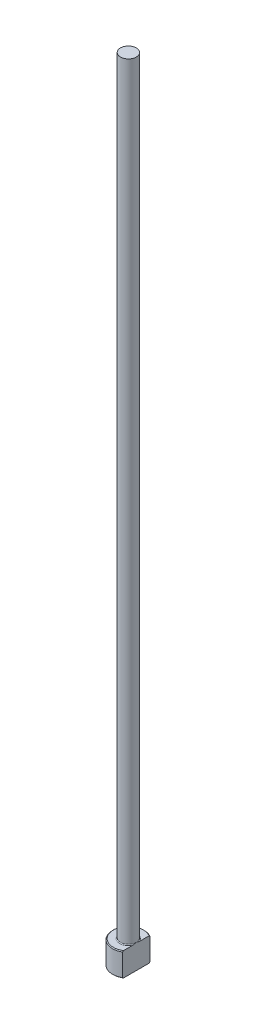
ISO-10303-21;
HEADER;
FILE_DESCRIPTION(('STEP AP214'),'2;1');
FILE_NAME('part.step','',(''),(''),'','','');
FILE_SCHEMA(('AUTOMOTIVE_DESIGN { 1 0 10303 214 1 1 1 1 }'));
ENDSEC;
DATA;
#1=APPLICATION_CONTEXT('core data for automotive mechanical design processes');
#2=APPLICATION_PROTOCOL_DEFINITION('international standard','automotive_design',2000,#1);
#3=PRODUCT_CONTEXT('',#1,'mechanical');
#4=PRODUCT('Part','Part','',(#3));
#5=PRODUCT_RELATED_PRODUCT_CATEGORY('part','',(#4));
#6=PRODUCT_DEFINITION_FORMATION('','',#4);
#7=PRODUCT_DEFINITION_CONTEXT('part definition',#1,'design');
#8=PRODUCT_DEFINITION('design','',#6,#7);
#9=PRODUCT_DEFINITION_SHAPE('','',#8);
#10=(LENGTH_UNIT() NAMED_UNIT(*) SI_UNIT(.MILLI.,.METRE.));
#11=(NAMED_UNIT(*) PLANE_ANGLE_UNIT() SI_UNIT($,.RADIAN.));
#12=(NAMED_UNIT(*) SI_UNIT($,.STERADIAN.) SOLID_ANGLE_UNIT());
#13=UNCERTAINTY_MEASURE_WITH_UNIT(LENGTH_MEASURE(1.E-05),#10,'distance_accuracy_value','');
#14=(GEOMETRIC_REPRESENTATION_CONTEXT(3) GLOBAL_UNCERTAINTY_ASSIGNED_CONTEXT((#13)) GLOBAL_UNIT_ASSIGNED_CONTEXT((#10,
#11,#12)) REPRESENTATION_CONTEXT('',''));
#15=CARTESIAN_POINT('',(0.,0.,0.));
#16=DIRECTION('',(0.,0.,1.));
#17=DIRECTION('',(1.,0.,0.));
#18=AXIS2_PLACEMENT_3D('',#15,#16,#17);
#19=CARTESIAN_POINT('',(0.,0.,0.));
#20=DIRECTION('',(0.,-1.,0.));
#21=DIRECTION('',(0.,0.,-1.));
#22=AXIS2_PLACEMENT_3D('',#19,#20,#21);
#23=PLANE('',#22);
#24=CARTESIAN_POINT('',(0.,0.,0.));
#25=DIRECTION('',(0.,-1.,0.));
#26=DIRECTION('',(0.,0.,-1.));
#27=AXIS2_PLACEMENT_3D('',#24,#25,#26);
#28=CIRCLE('',#27,3.79999999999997);
#29=CARTESIAN_POINT('',(1.99999999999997,0.,3.23109888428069));
#30=VERTEX_POINT('',#29);
#31=CARTESIAN_POINT('',(1.99999999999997,0.,-3.23109888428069));
#32=VERTEX_POINT('',#31);
#33=EDGE_CURVE('E98',#30,#32,#28,.T.);
#34=ORIENTED_EDGE('',*,*,#33,.T.);
#35=DIRECTION('',(0.,0.,1.));
#36=VECTOR('',#35,1.);
#37=CARTESIAN_POINT('',(1.99999999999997,0.,3.46410161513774));
#38=LINE('',#37,#36);
#39=EDGE_CURVE('E83',#32,#30,#38,.T.);
#40=ORIENTED_EDGE('',*,*,#39,.T.);
#41=EDGE_LOOP('',(#34,#40));
#42=FACE_BOUND('',#41,.T.);
#43=ADVANCED_FACE('F32',(#42),#23,.T.);
#44=CARTESIAN_POINT('',(0.,259.958771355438,0.));
#45=DIRECTION('',(0.,1.,0.));
#46=DIRECTION('',(0.,0.,1.));
#47=AXIS2_PLACEMENT_3D('',#44,#45,#46);
#48=CYLINDRICAL_SURFACE('',#47,3.99999999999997);
#49=CARTESIAN_POINT('',(0.,5.80000000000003,0.));
#50=DIRECTION('',(0.,1.,0.));
#51=DIRECTION('',(0.,0.,1.));
#52=AXIS2_PLACEMENT_3D('',#49,#50,#51);
#53=CIRCLE('',#52,3.99999999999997);
#54=CARTESIAN_POINT('',(1.99999999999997,5.80000000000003,3.46410161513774));
#55=VERTEX_POINT('',#54);
#56=CARTESIAN_POINT('',(1.99999999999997,5.80000000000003,-3.46410161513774));
#57=VERTEX_POINT('',#56);
#58=EDGE_CURVE('E104',#55,#57,#53,.F.);
#59=ORIENTED_EDGE('',*,*,#58,.T.);
#60=DIRECTION('',(0.,-1.,0.));
#61=VECTOR('',#60,1.);
#62=CARTESIAN_POINT('',(1.99999999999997,200.,-3.46410161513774));
#63=LINE('',#62,#61);
#64=CARTESIAN_POINT('',(1.99999999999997,0.199999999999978,-3.46410161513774));
#65=VERTEX_POINT('',#64);
#66=EDGE_CURVE('E183',#57,#65,#63,.T.);
#67=ORIENTED_EDGE('',*,*,#66,.T.);
#68=CARTESIAN_POINT('',(0.,0.199999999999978,0.));
#69=DIRECTION('',(0.,-1.,0.));
#70=DIRECTION('',(0.,0.,-1.));
#71=AXIS2_PLACEMENT_3D('',#68,#69,#70);
#72=CIRCLE('',#71,3.99999999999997);
#73=CARTESIAN_POINT('',(1.99999999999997,0.199999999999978,3.46410161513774));
#74=VERTEX_POINT('',#73);
#75=EDGE_CURVE('E100',#65,#74,#72,.F.);
#76=ORIENTED_EDGE('',*,*,#75,.T.);
#77=DIRECTION('',(0.,-1.,0.));
#78=VECTOR('',#77,1.);
#79=CARTESIAN_POINT('',(1.99999999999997,200.,3.46410161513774));
#80=LINE('',#79,#78);
#81=EDGE_CURVE('E93',#55,#74,#80,.T.);
#82=ORIENTED_EDGE('',*,*,#81,.F.);
#83=EDGE_LOOP('',(#59,#67,#76,#82));
#84=FACE_BOUND('',#83,.T.);
#85=ADVANCED_FACE('F158',(#84),#48,.T.);
#86=CARTESIAN_POINT('',(-3.99999999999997,6.,0.));
#87=DIRECTION('',(0.,1.,0.));
#88=DIRECTION('',(0.,0.,1.));
#89=AXIS2_PLACEMENT_3D('',#86,#87,#88);
#90=PLANE('',#89);
#91=CARTESIAN_POINT('',(0.,6.,0.));
#92=DIRECTION('',(0.,1.,0.));
#93=DIRECTION('',(0.,0.,1.));
#94=AXIS2_PLACEMENT_3D('',#91,#92,#93);
#95=CIRCLE('',#94,3.80000000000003);
#96=CARTESIAN_POINT('',(1.99999999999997,6.,-3.23109888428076));
#97=VERTEX_POINT('',#96);
#98=CARTESIAN_POINT('',(1.99999999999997,6.,3.23109888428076));
#99=VERTEX_POINT('',#98);
#100=EDGE_CURVE('E178',#97,#99,#95,.T.);
#101=ORIENTED_EDGE('',*,*,#100,.T.);
#102=DIRECTION('',(0.,0.,-1.));
#103=VECTOR('',#102,1.);
#104=CARTESIAN_POINT('',(1.99999999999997,6.,0.));
#105=LINE('',#104,#103);
#106=CARTESIAN_POINT('',(1.99999999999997,5.99999999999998,0.916515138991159));
#107=VERTEX_POINT('',#106);
#108=EDGE_CURVE('E57',#99,#107,#105,.T.);
#109=ORIENTED_EDGE('',*,*,#108,.T.);
#110=CARTESIAN_POINT('',(0.,6.,0.));
#111=DIRECTION('',(0.,1.,0.));
#112=DIRECTION('',(0.,0.,1.));
#113=AXIS2_PLACEMENT_3D('',#110,#111,#112);
#114=CIRCLE('',#113,2.19999999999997);
#115=CARTESIAN_POINT('',(1.99999999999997,5.99999999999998,-0.916515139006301));
#116=VERTEX_POINT('',#115);
#117=EDGE_CURVE('E107',#107,#116,#114,.F.);
#118=ORIENTED_EDGE('',*,*,#117,.T.);
#119=EDGE_CURVE('E136',#116,#97,#105,.T.);
#120=ORIENTED_EDGE('',*,*,#119,.T.);
#121=EDGE_LOOP('',(#101,#109,#118,#120));
#122=FACE_BOUND('',#121,.T.);
#123=ADVANCED_FACE('F147',(#122),#90,.T.);
#124=CARTESIAN_POINT('',(0.,6.00000000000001,0.));
#125=DIRECTION('',(0.,-1.,0.));
#126=DIRECTION('',(0.,0.,-1.));
#127=AXIS2_PLACEMENT_3D('',#124,#125,#126);
#128=CONICAL_SURFACE('',#127,3.80000000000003,0.785398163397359);
#129=ORIENTED_EDGE('',*,*,#58,.F.);
#130=CARTESIAN_POINT('',(1.99999999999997,1.91904532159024,7.62295524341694));
#131=CARTESIAN_POINT('',(1.99999999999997,2.08611243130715,7.4502239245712));
#132=CARTESIAN_POINT('',(1.99999999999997,2.25300024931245,7.27731861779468));
#133=CARTESIAN_POINT('',(1.99999999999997,2.58631125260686,6.93105655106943));
#134=CARTESIAN_POINT('',(1.99999999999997,2.75273443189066,6.75769978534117));
#135=CARTESIAN_POINT('',(1.99999999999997,3.08509080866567,6.41034692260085));
#136=CARTESIAN_POINT('',(1.99999999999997,3.25102371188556,6.23635054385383));
#137=CARTESIAN_POINT('',(1.99999999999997,3.58215598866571,5.88766284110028));
#138=CARTESIAN_POINT('',(1.99999999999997,3.74735536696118,5.71297152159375));
#139=CARTESIAN_POINT('',(1.99999999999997,4.0735385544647,5.36616839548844));
#140=CARTESIAN_POINT('',(1.99999999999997,4.23454099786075,5.19407412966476));
#141=CARTESIAN_POINT('',(1.99999999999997,4.55534102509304,4.8487666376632));
#142=CARTESIAN_POINT('',(1.99999999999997,4.71513861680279,4.67555341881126));
#143=CARTESIAN_POINT('',(1.99999999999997,5.0330618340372,4.32766569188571));
#144=CARTESIAN_POINT('',(1.99999999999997,5.19118781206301,4.15299150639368));
#145=CARTESIAN_POINT('',(1.99999999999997,5.50513944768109,3.80159134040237));
#146=CARTESIAN_POINT('',(1.99999999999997,5.66096519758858,3.62486544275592));
#147=CARTESIAN_POINT('',(1.99999999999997,5.90974646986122,3.33722425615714));
#148=CARTESIAN_POINT('',(1.99999999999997,6.00376148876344,3.22722645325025));
#149=CARTESIAN_POINT('',(1.99999999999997,6.19011825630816,3.00579987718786));
#150=CARTESIAN_POINT('',(1.99999999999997,6.28245983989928,2.89437096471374));
#151=CARTESIAN_POINT('',(1.99999999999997,6.46586188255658,2.66849662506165));
#152=CARTESIAN_POINT('',(1.99999999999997,6.55689849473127,2.5540317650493));
#153=CARTESIAN_POINT('',(1.99999999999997,6.73578809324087,2.32266819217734));
#154=CARTESIAN_POINT('',(1.99999999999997,6.82364184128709,2.20577007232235));
#155=CARTESIAN_POINT('',(1.99999999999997,6.99612756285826,1.96688707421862));
#156=CARTESIAN_POINT('',(1.99999999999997,7.08069035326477,1.84485190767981));
#157=CARTESIAN_POINT('',(1.99999999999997,7.24300264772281,1.59599329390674));
#158=CARTESIAN_POINT('',(1.99999999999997,7.32074277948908,1.46916359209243));
#159=CARTESIAN_POINT('',(1.99999999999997,7.42869763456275,1.27510066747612));
#160=CARTESIAN_POINT('',(1.99999999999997,7.46305374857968,1.21018943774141));
#161=CARTESIAN_POINT('',(1.99999999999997,7.52837146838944,1.07868835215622));
#162=CARTESIAN_POINT('',(1.99999999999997,7.55933245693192,1.01209819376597));
#163=CARTESIAN_POINT('',(1.99999999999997,7.6456686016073,0.809894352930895));
#164=CARTESIAN_POINT('',(1.99999999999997,7.69478214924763,0.671360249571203));
#165=CARTESIAN_POINT('',(1.99999999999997,7.74794829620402,0.463657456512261));
#166=CARTESIAN_POINT('',(1.99999999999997,7.76205065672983,0.397033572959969));
#167=CARTESIAN_POINT('',(1.99999999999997,7.78390371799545,0.262728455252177));
#168=CARTESIAN_POINT('',(1.99999999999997,7.79165498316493,0.195047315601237));
#169=CARTESIAN_POINT('',(1.99999999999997,7.80025690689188,0.0594528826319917));
#170=CARTESIAN_POINT('',(1.99999999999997,7.80112894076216,-0.00845903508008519));
#171=CARTESIAN_POINT('',(1.99999999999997,7.79596585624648,-0.144020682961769));
#172=CARTESIAN_POINT('',(1.99999999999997,7.78993016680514,-0.211670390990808));
#173=CARTESIAN_POINT('',(1.99999999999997,7.7714536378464,-0.345483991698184));
#174=CARTESIAN_POINT('',(1.99999999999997,7.75906777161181,-0.411655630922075));
#175=CARTESIAN_POINT('',(1.99999999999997,7.7286636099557,-0.542678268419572));
#176=CARTESIAN_POINT('',(1.99999999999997,7.7106446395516,-0.607529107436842));
#177=CARTESIAN_POINT('',(1.99999999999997,7.66972939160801,-0.73606439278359));
#178=CARTESIAN_POINT('',(1.99999999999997,7.64680564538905,-0.799739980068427));
#179=CARTESIAN_POINT('',(1.99999999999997,7.59700147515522,-0.925489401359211));
#180=CARTESIAN_POINT('',(1.99999999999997,7.57012185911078,-0.987563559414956));
#181=CARTESIAN_POINT('',(1.99999999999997,7.48443518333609,-1.17209020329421));
#182=CARTESIAN_POINT('',(1.99999999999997,7.42077407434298,-1.29228210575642));
#183=CARTESIAN_POINT('',(1.99999999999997,7.28502644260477,-1.52785770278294));
#184=CARTESIAN_POINT('',(1.99999999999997,7.21292931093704,-1.64323509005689));
#185=CARTESIAN_POINT('',(1.99999999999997,7.0628151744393,-1.87069387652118));
#186=CARTESIAN_POINT('',(1.99999999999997,6.98477595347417,-1.98276048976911));
#187=CARTESIAN_POINT('',(1.99999999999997,6.82481971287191,-2.20397837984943));
#188=CARTESIAN_POINT('',(1.99999999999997,6.74290465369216,-2.31313108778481));
#189=CARTESIAN_POINT('',(1.99999999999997,6.57517222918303,-2.53068545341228));
#190=CARTESIAN_POINT('',(1.99999999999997,6.48931769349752,-2.63905831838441));
#191=CARTESIAN_POINT('',(1.99999999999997,6.31548151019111,-2.85409686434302));
#192=CARTESIAN_POINT('',(1.99999999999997,6.22749963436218,-2.96076236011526));
#193=CARTESIAN_POINT('',(1.99999999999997,6.05015030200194,-3.17249211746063));
#194=CARTESIAN_POINT('',(1.99999999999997,5.96078672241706,-3.27755963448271));
#195=CARTESIAN_POINT('',(1.99999999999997,5.78082366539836,-3.48663191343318));
#196=CARTESIAN_POINT('',(1.99999999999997,5.69022416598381,-3.59063665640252));
#197=CARTESIAN_POINT('',(1.99999999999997,5.44796733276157,-3.86612439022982));
#198=CARTESIAN_POINT('',(1.99999999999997,5.29545972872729,-4.03685912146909));
#199=CARTESIAN_POINT('',(1.99999999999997,4.98858070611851,-4.3766480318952));
#200=CARTESIAN_POINT('',(1.99999999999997,4.83420923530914,-4.54570216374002));
#201=CARTESIAN_POINT('',(1.99999999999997,4.52396102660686,-4.882716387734));
#202=CARTESIAN_POINT('',(1.99999999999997,4.36808300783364,-5.05067529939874));
#203=CARTESIAN_POINT('',(1.99999999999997,4.05530513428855,-5.38563883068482));
#204=CARTESIAN_POINT('',(1.99999999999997,3.89840527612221,-5.55264344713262));
#205=CARTESIAN_POINT('',(1.99999999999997,3.59029018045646,-5.87905385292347));
#206=CARTESIAN_POINT('',(1.99999999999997,3.43910664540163,-6.03848959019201));
#207=CARTESIAN_POINT('',(1.99999999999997,3.13616436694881,-6.3568145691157));
#208=CARTESIAN_POINT('',(1.99999999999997,2.98440562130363,-6.51570380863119));
#209=CARTESIAN_POINT('',(1.99999999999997,2.68059501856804,-6.83286192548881));
#210=CARTESIAN_POINT('',(1.99999999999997,2.52854367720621,-6.99113129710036));
#211=CARTESIAN_POINT('',(1.99999999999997,2.22406035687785,-7.30730102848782));
#212=CARTESIAN_POINT('',(1.99999999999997,2.07162838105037,-7.46520139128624));
#213=CARTESIAN_POINT('',(1.99999999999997,1.91904532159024,-7.62295524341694));
#214=B_SPLINE_CURVE_WITH_KNOTS('',3,(#130,#131,#132,#133,#134,#135,#136,#137,#138,#139,#140,
#141,#142,#143,#144,#145,#146,#147,#148,#149,#150,#151,#152,#153,#154,#155,#156,#157,#158,#159,
#160,#161,#162,#163,#164,#165,#166,#167,#168,#169,#170,#171,#172,#173,#174,#175,#176,#177,#178,
#179,#180,#181,#182,#183,#184,#185,#186,#187,#188,#189,#190,#191,#192,#193,#194,#195,#196,#197,
#198,#199,#200,#201,#202,#203,#204,#205,#206,#207,#208,#209,#210,#211,#212,#213),.UNSPECIFIED.,
.F.,.F.,(4,2,2,2,2,2,2,2,2,2,2,2,2,2,2,2,2,2,2,2,2,2,2,2,2,2,2,2,2,2,2,2,2,2,2,2,2,2,2,2,2,4),
(0.,0.720921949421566,1.4418531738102,2.16315326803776,2.88444869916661,3.59144103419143,
4.29842874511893,5.00526427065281,5.71207135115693,6.14616174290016,6.58029471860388,
7.01901494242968,7.45762947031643,7.90290456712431,8.34878206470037,8.56901415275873,
8.78928621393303,9.22814472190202,9.43219512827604,9.63622739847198,9.83962544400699,
10.0430403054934,10.244723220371,10.4464303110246,10.6492980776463,10.8521244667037,
11.2595582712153,11.6675100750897,12.0770700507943,12.4864250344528,12.9011677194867,
13.3159550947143,13.7297367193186,14.1435257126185,14.8302935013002,15.5170805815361,
16.2045145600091,16.891950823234,17.5511045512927,18.2102608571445,18.8686819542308,
19.5270976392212),.UNSPECIFIED.);
#215=EDGE_CURVE('E135',#55,#99,#214,.T.);
#216=ORIENTED_EDGE('',*,*,#215,.T.);
#217=ORIENTED_EDGE('',*,*,#100,.F.);
#218=EDGE_CURVE('E127',#97,#57,#214,.T.);
#219=ORIENTED_EDGE('',*,*,#218,.T.);
#220=EDGE_LOOP('',(#129,#216,#217,#219));
#221=FACE_BOUND('',#220,.T.);
#222=ADVANCED_FACE('F143',(#221),#128,.T.);
#223=CARTESIAN_POINT('',(0.,0.199999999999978,0.));
#224=DIRECTION('',(0.,1.,0.));
#225=DIRECTION('',(0.,0.,1.));
#226=AXIS2_PLACEMENT_3D('',#223,#224,#225);
#227=CONICAL_SURFACE('',#226,3.99999999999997,0.785398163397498);
#228=ORIENTED_EDGE('',*,*,#75,.F.);
#229=CARTESIAN_POINT('',(1.99999999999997,4.08095467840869,-7.62295524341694));
#230=CARTESIAN_POINT('',(1.99999999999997,3.91388756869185,-7.45022392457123));
#231=CARTESIAN_POINT('',(1.99999999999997,3.74699975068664,-7.27731861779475));
#232=CARTESIAN_POINT('',(1.99999999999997,3.41368874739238,-6.93105655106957));
#233=CARTESIAN_POINT('',(1.99999999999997,3.24726556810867,-6.75769978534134));
#234=CARTESIAN_POINT('',(1.99999999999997,2.91490919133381,-6.4103469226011));
#235=CARTESIAN_POINT('',(1.99999999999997,2.748976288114,-6.23635054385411));
#236=CARTESIAN_POINT('',(1.99999999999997,2.41784401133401,-5.88766284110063));
#237=CARTESIAN_POINT('',(1.99999999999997,2.25264463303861,-5.71297152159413));
#238=CARTESIAN_POINT('',(1.99999999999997,1.92646144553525,-5.36616839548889));
#239=CARTESIAN_POINT('',(1.99999999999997,1.76545900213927,-5.19407412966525));
#240=CARTESIAN_POINT('',(1.99999999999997,1.44465897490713,-4.84876663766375));
#241=CARTESIAN_POINT('',(1.99999999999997,1.28486138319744,-4.67555341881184));
#242=CARTESIAN_POINT('',(1.99999999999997,0.966938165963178,-4.32766569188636));
#243=CARTESIAN_POINT('',(1.99999999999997,0.80881218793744,-4.15299150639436));
#244=CARTESIAN_POINT('',(1.99999999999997,0.494860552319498,-3.80159134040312));
#245=CARTESIAN_POINT('',(1.99999999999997,0.339034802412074,-3.62486544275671));
#246=CARTESIAN_POINT('',(1.99999999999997,0.0902535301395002,-3.33722425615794));
#247=CARTESIAN_POINT('',(1.99999999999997,-0.00376148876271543,-3.22722645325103));
#248=CARTESIAN_POINT('',(1.99999999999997,-0.190118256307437,-3.00579987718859));
#249=CARTESIAN_POINT('',(1.99999999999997,-0.282459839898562,-2.89437096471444));
#250=CARTESIAN_POINT('',(1.99999999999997,-0.465861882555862,-2.66849662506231));
#251=CARTESIAN_POINT('',(1.99999999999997,-0.556898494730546,-2.55403176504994));
#252=CARTESIAN_POINT('',(1.99999999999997,-0.735788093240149,-2.32266819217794));
#253=CARTESIAN_POINT('',(1.99999999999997,-0.823641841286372,-2.20577007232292));
#254=CARTESIAN_POINT('',(1.99999999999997,-0.996127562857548,-1.96688707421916));
#255=CARTESIAN_POINT('',(1.99999999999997,-1.08069035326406,-1.84485190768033));
#256=CARTESIAN_POINT('',(1.99999999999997,-1.24300264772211,-1.59599329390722));
#257=CARTESIAN_POINT('',(1.99999999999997,-1.32074277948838,-1.46916359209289));
#258=CARTESIAN_POINT('',(1.99999999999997,-1.42869763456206,-1.27510066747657));
#259=CARTESIAN_POINT('',(1.99999999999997,-1.46305374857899,-1.21018943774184));
#260=CARTESIAN_POINT('',(1.99999999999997,-1.52837146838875,-1.07868835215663));
#261=CARTESIAN_POINT('',(1.99999999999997,-1.55933245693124,-1.01209819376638));
#262=CARTESIAN_POINT('',(1.99999999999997,-1.64566860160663,-0.809894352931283));
#263=CARTESIAN_POINT('',(1.99999999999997,-1.69478214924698,-0.671360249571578));
#264=CARTESIAN_POINT('',(1.99999999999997,-1.7479482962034,-0.463657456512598));
#265=CARTESIAN_POINT('',(1.99999999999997,-1.76205065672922,-0.397033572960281));
#266=CARTESIAN_POINT('',(1.99999999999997,-1.78390371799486,-0.262728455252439));
#267=CARTESIAN_POINT('',(1.99999999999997,-1.79165498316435,-0.195047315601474));
#268=CARTESIAN_POINT('',(1.99999999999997,-1.80025690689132,-0.0594528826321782));
#269=CARTESIAN_POINT('',(1.99999999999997,-1.8011289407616,0.00845903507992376));
#270=CARTESIAN_POINT('',(1.99999999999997,-1.79596585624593,0.144020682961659));
#271=CARTESIAN_POINT('',(1.99999999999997,-1.78993016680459,0.211670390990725));
#272=CARTESIAN_POINT('',(1.99999999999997,-1.77145363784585,0.345483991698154));
#273=CARTESIAN_POINT('',(1.99999999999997,-1.75906777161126,0.41165563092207));
#274=CARTESIAN_POINT('',(1.99999999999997,-1.72866360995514,0.542678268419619));
#275=CARTESIAN_POINT('',(1.99999999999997,-1.71064463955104,0.607529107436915));
#276=CARTESIAN_POINT('',(1.99999999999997,-1.66972939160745,0.736064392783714));
#277=CARTESIAN_POINT('',(1.99999999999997,-1.64680564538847,0.799739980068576));
#278=CARTESIAN_POINT('',(1.99999999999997,-1.59700147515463,0.92548940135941));
#279=CARTESIAN_POINT('',(1.99999999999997,-1.57012185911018,0.987563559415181));
#280=CARTESIAN_POINT('',(1.99999999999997,-1.48443518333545,1.17209020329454));
#281=CARTESIAN_POINT('',(1.99999999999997,-1.4207740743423,1.29228210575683));
#282=CARTESIAN_POINT('',(1.99999999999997,-1.28502644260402,1.52785770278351));
#283=CARTESIAN_POINT('',(1.99999999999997,-1.21292931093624,1.64323509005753));
#284=CARTESIAN_POINT('',(1.99999999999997,-1.06281517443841,1.87069387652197));
#285=CARTESIAN_POINT('',(1.99999999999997,-0.984775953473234,1.98276048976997));
#286=CARTESIAN_POINT('',(1.99999999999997,-0.824819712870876,2.20397837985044));
#287=CARTESIAN_POINT('',(1.99999999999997,-0.742904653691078,2.31313108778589));
#288=CARTESIAN_POINT('',(1.99999999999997,-0.575172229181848,2.5306854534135));
#289=CARTESIAN_POINT('',(1.99999999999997,-0.489317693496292,2.6390583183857));
#290=CARTESIAN_POINT('',(1.99999999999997,-0.315481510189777,2.85409686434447));
#291=CARTESIAN_POINT('',(1.99999999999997,-0.227499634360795,2.96076236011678));
#292=CARTESIAN_POINT('',(1.99999999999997,-0.0501503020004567,3.1724921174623));
#293=CARTESIAN_POINT('',(1.99999999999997,0.0392132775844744,3.27755963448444));
#294=CARTESIAN_POINT('',(1.99999999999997,0.219176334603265,3.48663191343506));
#295=CARTESIAN_POINT('',(1.99999999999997,0.309775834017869,3.59063665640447));
#296=CARTESIAN_POINT('',(1.99999999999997,0.552032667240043,3.86612439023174));
#297=CARTESIAN_POINT('',(1.99999999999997,0.704540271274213,4.03685912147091));
#298=CARTESIAN_POINT('',(1.99999999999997,1.01141929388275,4.37664803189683));
#299=CARTESIAN_POINT('',(1.99999999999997,1.16579076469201,4.54570216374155));
#300=CARTESIAN_POINT('',(1.99999999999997,1.47603897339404,4.88271638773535));
#301=CARTESIAN_POINT('',(1.99999999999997,1.63191699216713,5.05067529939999));
#302=CARTESIAN_POINT('',(1.99999999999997,1.94469486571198,5.38563883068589));
#303=CARTESIAN_POINT('',(1.99999999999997,2.10159472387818,5.5526434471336));
#304=CARTESIAN_POINT('',(1.99999999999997,2.40970981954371,5.87905385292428));
#305=CARTESIAN_POINT('',(1.99999999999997,2.56089335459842,6.03848959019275));
#306=CARTESIAN_POINT('',(1.99999999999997,2.86383563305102,6.35681456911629));
#307=CARTESIAN_POINT('',(1.99999999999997,3.01559437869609,6.5157038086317));
#308=CARTESIAN_POINT('',(1.99999999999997,3.31940498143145,6.83286192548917));
#309=CARTESIAN_POINT('',(1.99999999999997,3.47145632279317,6.99113129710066));
#310=CARTESIAN_POINT('',(1.99999999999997,3.7759396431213,7.30730102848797));
#311=CARTESIAN_POINT('',(1.99999999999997,3.92837161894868,7.46520139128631));
#312=CARTESIAN_POINT('',(1.99999999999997,4.08095467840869,7.62295524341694));
#313=B_SPLINE_CURVE_WITH_KNOTS('',3,(#229,#230,#231,#232,#233,#234,#235,#236,#237,#238,#239,
#240,#241,#242,#243,#244,#245,#246,#247,#248,#249,#250,#251,#252,#253,#254,#255,#256,#257,#258,
#259,#260,#261,#262,#263,#264,#265,#266,#267,#268,#269,#270,#271,#272,#273,#274,#275,#276,#277,
#278,#279,#280,#281,#282,#283,#284,#285,#286,#287,#288,#289,#290,#291,#292,#293,#294,#295,#296,
#297,#298,#299,#300,#301,#302,#303,#304,#305,#306,#307,#308,#309,#310,#311,#312),.UNSPECIFIED.,
.F.,.F.,(4,2,2,2,2,2,2,2,2,2,2,2,2,2,2,2,2,2,2,2,2,2,2,2,2,2,2,2,2,2,2,2,2,2,2,2,2,2,2,2,2,4),
(0.,0.720921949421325,1.44185317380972,2.16315326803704,2.88444869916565,3.59144103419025,
4.29842874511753,5.0052642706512,5.71207135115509,6.14616174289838,6.58029471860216,
7.01901494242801,7.45762947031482,7.90290456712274,8.34878206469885,8.56901415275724,
8.78928621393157,9.22814472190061,9.43219512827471,9.63622739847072,9.83962544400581,
10.0430403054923,10.24472322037,10.4464303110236,10.6492980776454,10.852124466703,
11.2595582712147,11.6675100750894,12.0770700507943,12.4864250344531,12.9011677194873,
13.3159550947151,13.7297367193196,14.1435257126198,14.8302935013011,15.5170805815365,
16.204514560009,16.8919508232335,17.5511045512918,18.2102608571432,18.8686819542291,
19.5270976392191),.UNSPECIFIED.);
#314=EDGE_CURVE('E86',#65,#32,#313,.T.);
#315=ORIENTED_EDGE('',*,*,#314,.T.);
#316=ORIENTED_EDGE('',*,*,#33,.F.);
#317=EDGE_CURVE('E89',#30,#74,#313,.T.);
#318=ORIENTED_EDGE('',*,*,#317,.T.);
#319=EDGE_LOOP('',(#228,#315,#316,#318));
#320=FACE_BOUND('',#319,.T.);
#321=ADVANCED_FACE('F97',(#320),#227,.T.);
#322=CARTESIAN_POINT('',(0.,6.19999999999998,0.));
#323=DIRECTION('',(0.,1.,0.));
#324=DIRECTION('',(0.,0.,1.));
#325=AXIS2_PLACEMENT_3D('',#322,#323,#324);
#326=TOROIDAL_SURFACE('',#325,2.19999999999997,0.2);
#327=CARTESIAN_POINT('',(1.99999999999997,6.19999999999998,0.));
#328=CARTESIAN_POINT('',(1.99999999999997,6.20000050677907,1.13930197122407E-10));
#329=CARTESIAN_POINT('',(1.99999999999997,6.20000101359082,-1.46766795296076E-07));
#330=CARTESIAN_POINT('',(1.99999999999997,6.20000197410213,-5.82067450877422E-07));
#331=CARTESIAN_POINT('',(1.99999999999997,6.20000242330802,-8.77873017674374E-07));
#332=CARTESIAN_POINT('',(1.99999999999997,6.2000033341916,-1.58424515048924E-06));
#333=CARTESIAN_POINT('',(1.99999999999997,6.20000378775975,-2.00534283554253E-06));
#334=CARTESIAN_POINT('',(1.99999999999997,6.20000462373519,-2.89558841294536E-06));
#335=CARTESIAN_POINT('',(1.99999999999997,6.20000500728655,-3.36372325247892E-06));
#336=CARTESIAN_POINT('',(1.99999999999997,6.20000636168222,-5.10887550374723E-06));
#337=CARTESIAN_POINT('',(1.99999999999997,6.20000725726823,-6.44597279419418E-06));
#338=CARTESIAN_POINT('',(1.99999999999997,6.20000879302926,-9.14926716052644E-06));
#339=CARTESIAN_POINT('',(1.99999999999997,6.20000944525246,-1.05089714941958E-05));
#340=CARTESIAN_POINT('',(1.99999999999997,6.20001204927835,-1.60555880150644E-05));
#341=CARTESIAN_POINT('',(1.99999999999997,6.20001390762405,-2.02908747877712E-05));
#342=CARTESIAN_POINT('',(1.99999999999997,6.20001676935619,-2.8443849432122E-05));
#343=CARTESIAN_POINT('',(1.99999999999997,6.20001785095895,-3.23343259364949E-05));
#344=CARTESIAN_POINT('',(1.99999999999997,6.20002551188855,-6.06027145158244E-05));
#345=CARTESIAN_POINT('',(1.99999999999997,6.20003111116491,-8.51991847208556E-05));
#346=CARTESIAN_POINT('',(1.99999999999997,6.20005559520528,-0.000181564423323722));
#347=CARTESIAN_POINT('',(1.99999999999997,6.20007914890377,-0.000252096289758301));
#348=CARTESIAN_POINT('',(1.99999999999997,6.20017002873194,-0.000529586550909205));
#349=CARTESIAN_POINT('',(1.99999999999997,6.20023415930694,-0.000737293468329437));
#350=CARTESIAN_POINT('',(1.99999999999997,6.20048926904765,-0.00155657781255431));
#351=CARTESIAN_POINT('',(1.99999999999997,6.2006841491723,-0.00216722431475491));
#352=CARTESIAN_POINT('',(1.99999999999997,6.20148805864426,-0.00469384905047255));
#353=CARTESIAN_POINT('',(1.99999999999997,6.20209226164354,-0.00661098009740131));
#354=CARTESIAN_POINT('',(1.99999999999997,6.20822779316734,-0.0260695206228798));
#355=CARTESIAN_POINT('',(1.99999999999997,6.21378174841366,-0.0436057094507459));
#356=CARTESIAN_POINT('',(1.99999999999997,6.22462834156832,-0.0780127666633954));
#357=CARTESIAN_POINT('',(1.99999999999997,6.22992277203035,-0.0948831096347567));
#358=CARTESIAN_POINT('',(1.99999999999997,6.24110477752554,-0.130713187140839));
#359=CARTESIAN_POINT('',(1.99999999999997,6.24698536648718,-0.149675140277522));
#360=CARTESIAN_POINT('',(1.99999999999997,6.25869835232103,-0.187834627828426));
#361=CARTESIAN_POINT('',(1.99999999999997,6.26452957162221,-0.20703252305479));
#362=CARTESIAN_POINT('',(1.99999999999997,6.27861584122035,-0.254071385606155));
#363=CARTESIAN_POINT('',(1.99999999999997,6.28678835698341,-0.281937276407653));
#364=CARTESIAN_POINT('',(1.99999999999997,6.30249503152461,-0.33711523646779));
#365=CARTESIAN_POINT('',(1.99999999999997,6.31003989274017,-0.364424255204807));
#366=CARTESIAN_POINT('',(1.99999999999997,6.32554795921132,-0.422841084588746));
#367=CARTESIAN_POINT('',(1.99999999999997,6.33343288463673,-0.453970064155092));
#368=CARTESIAN_POINT('',(1.99999999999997,6.34833120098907,-0.516667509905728));
#369=CARTESIAN_POINT('',(1.99999999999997,6.3553379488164,-0.548237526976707));
#370=CARTESIAN_POINT('',(1.99999999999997,6.37554978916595,-0.647984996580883));
#371=CARTESIAN_POINT('',(1.99999999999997,6.38665117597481,-0.716635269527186));
#372=CARTESIAN_POINT('',(1.99999999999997,6.39785773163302,-0.8324457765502));
#373=CARTESIAN_POINT('',(1.99999999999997,6.40036304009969,-0.879345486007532));
#374=CARTESIAN_POINT('',(1.99999999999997,6.39976024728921,-0.949238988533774));
#375=CARTESIAN_POINT('',(1.99999999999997,6.39886048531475,-0.97224857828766));
#376=CARTESIAN_POINT('',(1.99999999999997,6.39534463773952,-1.01812773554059));
#377=CARTESIAN_POINT('',(1.99999999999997,6.39273014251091,-1.04099741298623));
#378=CARTESIAN_POINT('',(1.99999999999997,6.38623968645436,-1.08102660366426));
#379=CARTESIAN_POINT('',(1.99999999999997,6.38280841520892,-1.09825717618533));
#380=CARTESIAN_POINT('',(1.99999999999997,6.37442567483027,-1.13243508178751));
#381=CARTESIAN_POINT('',(1.99999999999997,6.36946777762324,-1.14938089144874));
#382=CARTESIAN_POINT('',(1.99999999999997,6.35764172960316,-1.18276398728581));
#383=CARTESIAN_POINT('',(1.99999999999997,6.35075810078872,-1.1991959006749));
#384=CARTESIAN_POINT('',(1.99999999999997,6.33462082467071,-1.23083581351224));
#385=CARTESIAN_POINT('',(1.99999999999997,6.32537783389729,-1.24604892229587));
#386=CARTESIAN_POINT('',(1.99999999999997,6.30929159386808,-1.26715296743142));
#387=CARTESIAN_POINT('',(1.99999999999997,6.303567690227,-1.27389441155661));
#388=CARTESIAN_POINT('',(1.99999999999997,6.29128925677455,-1.28659894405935));
#389=CARTESIAN_POINT('',(1.99999999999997,6.28473413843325,-1.29256147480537));
#390=CARTESIAN_POINT('',(1.99999999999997,6.27066594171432,-1.30346436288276));
#391=CARTESIAN_POINT('',(1.99999999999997,6.26314132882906,-1.30839014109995));
#392=CARTESIAN_POINT('',(1.99999999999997,6.24727957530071,-1.31668687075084));
#393=CARTESIAN_POINT('',(1.99999999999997,6.23894498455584,-1.32006252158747));
#394=CARTESIAN_POINT('',(1.99999999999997,6.22424089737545,-1.3241557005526));
#395=CARTESIAN_POINT('',(1.99999999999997,6.21800630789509,-1.32536112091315));
#396=CARTESIAN_POINT('',(1.99999999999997,6.2054226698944,-1.32669615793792));
#397=CARTESIAN_POINT('',(1.99999999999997,6.19907368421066,-1.32682634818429));
#398=CARTESIAN_POINT('',(1.99999999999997,6.18645152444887,-1.32599950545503));
#399=CARTESIAN_POINT('',(1.99999999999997,6.18017831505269,-1.32504300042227));
#400=CARTESIAN_POINT('',(1.99999999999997,6.16787181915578,-1.32212308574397));
#401=CARTESIAN_POINT('',(1.99999999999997,6.16183869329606,-1.32015901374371));
#402=CARTESIAN_POINT('',(1.99999999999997,6.14844260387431,-1.31466566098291));
#403=CARTESIAN_POINT('',(1.99999999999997,6.14119825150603,-1.3108482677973));
#404=CARTESIAN_POINT('',(1.99999999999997,6.12742328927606,-1.30209252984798));
#405=CARTESIAN_POINT('',(1.99999999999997,6.12089414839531,-1.29715193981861));
#406=CARTESIAN_POINT('',(1.99999999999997,6.10554761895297,-1.28382084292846));
#407=CARTESIAN_POINT('',(1.99999999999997,6.09717242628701,-1.27492468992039));
#408=CARTESIAN_POINT('',(1.99999999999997,6.08188323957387,-1.25597903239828));
#409=CARTESIAN_POINT('',(1.99999999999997,6.07497120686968,-1.24592800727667));
#410=CARTESIAN_POINT('',(1.99999999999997,6.05771073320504,-1.21734573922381));
#411=CARTESIAN_POINT('',(1.99999999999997,6.04862251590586,-1.19806017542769));
#412=CARTESIAN_POINT('',(1.99999999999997,6.03323781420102,-1.15830155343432));
#413=CARTESIAN_POINT('',(1.99999999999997,6.02696471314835,-1.13782009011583));
#414=CARTESIAN_POINT('',(1.99999999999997,6.01659159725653,-1.09607450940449));
#415=CARTESIAN_POINT('',(1.99999999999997,6.01251776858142,-1.07480405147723));
#416=CARTESIAN_POINT('',(1.99999999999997,6.0061890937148,-1.03196822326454));
#417=CARTESIAN_POINT('',(1.99999999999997,6.00393768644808,-1.0104023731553));
#418=CARTESIAN_POINT('',(1.99999999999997,5.99950887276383,-0.946948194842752));
#419=CARTESIAN_POINT('',(1.99999999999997,5.99937097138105,-0.904921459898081));
#420=CARTESIAN_POINT('',(1.99999999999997,6.00391139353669,-0.800067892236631));
#421=CARTESIAN_POINT('',(1.99999999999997,6.01103947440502,-0.737378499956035));
#422=CARTESIAN_POINT('',(1.99999999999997,6.0310998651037,-0.611444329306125));
#423=CARTESIAN_POINT('',(1.99999999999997,6.04417074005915,-0.548223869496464));
#424=CARTESIAN_POINT('',(1.99999999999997,6.06920011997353,-0.442888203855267));
#425=CARTESIAN_POINT('',(1.99999999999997,6.08016343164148,-0.400527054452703));
#426=CARTESIAN_POINT('',(1.99999999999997,6.10315303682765,-0.316588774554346));
#427=CARTESIAN_POINT('',(1.99999999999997,6.11516655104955,-0.275008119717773));
#428=CARTESIAN_POINT('',(1.99999999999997,6.13853403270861,-0.196672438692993));
#429=CARTESIAN_POINT('',(1.99999999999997,6.14981294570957,-0.159894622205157));
#430=CARTESIAN_POINT('',(1.99999999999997,6.17316886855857,-0.0849211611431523));
#431=CARTESIAN_POINT('',(1.99999999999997,6.18525959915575,-0.0467297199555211));
#432=CARTESIAN_POINT('',(1.99999999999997,6.19790869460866,-0.00660765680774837));
#433=CARTESIAN_POINT('',(1.99999999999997,6.19851400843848,-0.00468723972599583));
#434=CARTESIAN_POINT('',(1.99999999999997,6.19931818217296,-0.00215985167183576));
#435=CARTESIAN_POINT('',(1.99999999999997,6.19951225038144,-0.00155173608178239));
#436=CARTESIAN_POINT('',(1.99999999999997,6.19976637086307,-0.000735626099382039));
#437=CARTESIAN_POINT('',(1.99999999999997,6.19983030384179,-0.000528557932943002));
#438=CARTESIAN_POINT('',(1.99999999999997,6.19992094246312,-0.000251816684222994));
#439=CARTESIAN_POINT('',(1.99999999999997,6.19994446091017,-0.000181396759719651));
#440=CARTESIAN_POINT('',(1.99999999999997,6.19996891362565,-8.516223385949E-05));
#441=CARTESIAN_POINT('',(1.99999999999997,6.19997450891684,-6.05824645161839E-05));
#442=CARTESIAN_POINT('',(1.99999999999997,6.19998216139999,-3.23308902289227E-05));
#443=CARTESIAN_POINT('',(1.99999999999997,6.19998324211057,-2.84414359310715E-05));
#444=CARTESIAN_POINT('',(1.99999999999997,6.19998610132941,-2.02904710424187E-05));
#445=CARTESIAN_POINT('',(1.99999999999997,6.19998795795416,-1.60561198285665E-05));
#446=CARTESIAN_POINT('',(1.99999999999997,6.19999055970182,-1.05104411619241E-05));
#447=CARTESIAN_POINT('',(1.99999999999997,6.19999121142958,-9.15081316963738E-06));
#448=CARTESIAN_POINT('',(1.99999999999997,6.1999927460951,-6.44758195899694E-06));
#449=CARTESIAN_POINT('',(1.99999999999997,6.19999364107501,-5.11046373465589E-06));
#450=CARTESIAN_POINT('',(1.99999999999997,6.19999499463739,-3.36517635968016E-06));
#451=CARTESIAN_POINT('',(1.99999999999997,6.19999537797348,-2.89697955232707E-06));
#452=CARTESIAN_POINT('',(1.99999999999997,6.19999621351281,-2.00657125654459E-06));
#453=CARTESIAN_POINT('',(1.99999999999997,6.19999666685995,-1.58537196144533E-06));
#454=CARTESIAN_POINT('',(1.99999999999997,6.19999757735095,-8.78757217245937E-07));
#455=CARTESIAN_POINT('',(1.99999999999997,6.19999802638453,-5.82817893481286E-07));
#456=CARTESIAN_POINT('',(1.99999999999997,6.19999898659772,-1.4718673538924E-07));
#457=CARTESIAN_POINT('',(1.99999999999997,6.19999949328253,-1.13916340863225E-10));
#458=CARTESIAN_POINT('',(1.99999999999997,6.19999999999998,0.));
#459=B_SPLINE_CURVE_WITH_KNOTS('',3,(#327,#328,#329,#330,#331,#332,#333,#334,#335,#336,#337,
#338,#339,#340,#341,#342,#343,#344,#345,#346,#347,#348,#349,#350,#351,#352,#353,#354,#355,#356,
#357,#358,#359,#360,#361,#362,#363,#364,#365,#366,#367,#368,#369,#370,#371,#372,#373,#374,#375,
#376,#377,#378,#379,#380,#381,#382,#383,#384,#385,#386,#387,#388,#389,#390,#391,#392,#393,#394,
#395,#396,#397,#398,#399,#400,#401,#402,#403,#404,#405,#406,#407,#408,#409,#410,#411,#412,#413,
#414,#415,#416,#417,#418,#419,#420,#421,#422,#423,#424,#425,#426,#427,#428,#429,#430,#431,#432,
#433,#434,#435,#436,#437,#438,#439,#440,#441,#442,#443,#444,#445,#446,#447,#448,#449,#450,#451,
#452,#453,#454,#455,#456,#457,#458),.UNSPECIFIED.,.T.,.F.,(4,2,2,2,2,2,2,2,2,2,2,2,2,2,2,2,2,2,
2,2,2,2,2,2,2,2,2,2,2,2,2,2,2,2,2,2,2,2,2,2,2,2,2,2,2,2,2,2,2,2,2,2,2,2,2,2,2,2,2,2,2,2,2,2,2,
4),(0.,1.52369882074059E-06,3.13175174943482E-06,4.97933869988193E-06,6.79332712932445E-06,
1.16005918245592E-05,1.61211188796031E-05,2.99630984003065E-05,4.20611839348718E-05,
0.000117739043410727,0.000340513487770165,0.000992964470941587,0.00291555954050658,
0.00894623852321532,0.0641278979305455,0.117173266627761,0.176731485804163,0.236923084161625,
0.324038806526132,0.409031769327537,0.505353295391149,0.602364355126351,0.810598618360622,
0.951214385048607,1.02024793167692,1.08921754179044,1.14187257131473,1.19475241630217,
1.24807013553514,1.30115116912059,1.32762610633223,1.35411989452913,1.38096446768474,
1.40772711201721,1.42669285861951,1.44564848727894,1.46459491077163,1.48355380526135,
1.50798338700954,1.53246223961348,1.56891061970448,1.60540755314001,1.66900939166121,
1.73313017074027,1.7979984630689,1.86298887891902,1.98877684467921,2.17764082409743,
2.37115413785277,2.50240556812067,2.63223743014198,2.74764208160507,2.86781494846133,
2.87385601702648,2.87577064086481,2.87642108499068,2.87664350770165,2.87671913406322,
2.87673122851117,2.87674506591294,2.87674958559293,2.87675439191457,2.87675620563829,
2.87675805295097,2.87675966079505,2.87676118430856),.UNSPECIFIED.);
#460=CARTESIAN_POINT('',(1.99999999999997,6.19999999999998,0.));
#461=VERTEX_POINT('',#460);
#462=EDGE_CURVE('E11',#116,#461,#459,.T.);
#463=ORIENTED_EDGE('',*,*,#462,.F.);
#464=ORIENTED_EDGE('',*,*,#117,.F.);
#465=CARTESIAN_POINT('',(1.99999999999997,6.19999999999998,0.));
#466=CARTESIAN_POINT('',(1.99999999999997,6.19999949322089,-1.13930196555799E-10));
#467=CARTESIAN_POINT('',(1.99999999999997,6.19999898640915,1.4676679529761E-07));
#468=CARTESIAN_POINT('',(1.99999999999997,6.19999802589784,5.82067450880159E-07));
#469=CARTESIAN_POINT('',(1.99999999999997,6.19999757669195,8.77873017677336E-07));
#470=CARTESIAN_POINT('',(1.99999999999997,6.19999666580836,1.58424515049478E-06));
#471=CARTESIAN_POINT('',(1.99999999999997,6.19999621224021,2.00534283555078E-06));
#472=CARTESIAN_POINT('',(1.99999999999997,6.19999537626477,2.89558841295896E-06));
#473=CARTESIAN_POINT('',(1.99999999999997,6.19999499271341,3.3637232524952E-06));
#474=CARTESIAN_POINT('',(1.99999999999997,6.19999363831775,5.10887550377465E-06));
#475=CARTESIAN_POINT('',(1.99999999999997,6.19999274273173,6.44597279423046E-06));
#476=CARTESIAN_POINT('',(1.99999999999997,6.1999912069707,9.14926716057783E-06));
#477=CARTESIAN_POINT('',(1.99999999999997,6.19999055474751,1.05089714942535E-05));
#478=CARTESIAN_POINT('',(1.99999999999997,6.19998795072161,1.60555880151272E-05));
#479=CARTESIAN_POINT('',(1.99999999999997,6.19998609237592,2.02908747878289E-05));
#480=CARTESIAN_POINT('',(1.99999999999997,6.19998323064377,2.84438494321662E-05));
#481=CARTESIAN_POINT('',(1.99999999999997,6.19998214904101,3.23343259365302E-05));
#482=CARTESIAN_POINT('',(1.99999999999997,6.19997448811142,6.06027145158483E-05));
#483=CARTESIAN_POINT('',(1.99999999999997,6.19996888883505,8.51991847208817E-05));
#484=CARTESIAN_POINT('',(1.99999999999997,6.19994440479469,0.000181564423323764));
#485=CARTESIAN_POINT('',(1.99999999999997,6.1999208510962,0.000252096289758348));
#486=CARTESIAN_POINT('',(1.99999999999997,6.19982997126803,0.000529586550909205));
#487=CARTESIAN_POINT('',(1.99999999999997,6.19976584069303,0.000737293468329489));
#488=CARTESIAN_POINT('',(1.99999999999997,6.19951073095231,0.00155657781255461));
#489=CARTESIAN_POINT('',(1.99999999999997,6.19931585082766,0.00216722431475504));
#490=CARTESIAN_POINT('',(1.99999999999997,6.1985119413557,0.00469384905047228));
#491=CARTESIAN_POINT('',(1.99999999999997,6.19790773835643,0.00661098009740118));
#492=CARTESIAN_POINT('',(1.99999999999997,6.19177220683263,0.0260695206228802));
#493=CARTESIAN_POINT('',(1.99999999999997,6.18621825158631,0.0436057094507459));
#494=CARTESIAN_POINT('',(1.99999999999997,6.17537165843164,0.0780127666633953));
#495=CARTESIAN_POINT('',(1.99999999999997,6.17007722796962,0.0948831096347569));
#496=CARTESIAN_POINT('',(1.99999999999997,6.15889522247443,0.130713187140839));
#497=CARTESIAN_POINT('',(1.99999999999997,6.15301463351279,0.149675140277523));
#498=CARTESIAN_POINT('',(1.99999999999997,6.14130164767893,0.187834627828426));
#499=CARTESIAN_POINT('',(1.99999999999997,6.13547042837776,0.20703252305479));
#500=CARTESIAN_POINT('',(1.99999999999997,6.12138415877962,0.254071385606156));
#501=CARTESIAN_POINT('',(1.99999999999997,6.11321164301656,0.281937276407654));
#502=CARTESIAN_POINT('',(1.99999999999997,6.09750496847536,0.337115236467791));
#503=CARTESIAN_POINT('',(1.99999999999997,6.0899601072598,0.364424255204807));
#504=CARTESIAN_POINT('',(1.99999999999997,6.07445204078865,0.422841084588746));
#505=CARTESIAN_POINT('',(1.99999999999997,6.06656711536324,0.453970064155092));
#506=CARTESIAN_POINT('',(1.99999999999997,6.0516687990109,0.516667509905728));
#507=CARTESIAN_POINT('',(1.99999999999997,6.04466205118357,0.548237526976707));
#508=CARTESIAN_POINT('',(1.99999999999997,6.02445021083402,0.647984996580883));
#509=CARTESIAN_POINT('',(1.99999999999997,6.01334882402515,0.716635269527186));
#510=CARTESIAN_POINT('',(1.99999999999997,6.00214226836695,0.8324457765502));
#511=CARTESIAN_POINT('',(1.99999999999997,5.99963695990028,0.879345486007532));
#512=CARTESIAN_POINT('',(1.99999999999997,6.00023975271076,0.949238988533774));
#513=CARTESIAN_POINT('',(1.99999999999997,6.00113951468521,0.97224857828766));
#514=CARTESIAN_POINT('',(1.99999999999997,6.00465536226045,1.01812773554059));
#515=CARTESIAN_POINT('',(1.99999999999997,6.00726985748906,1.04099741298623));
#516=CARTESIAN_POINT('',(1.99999999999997,6.01376031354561,1.08102660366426));
#517=CARTESIAN_POINT('',(1.99999999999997,6.01719158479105,1.09825717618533));
#518=CARTESIAN_POINT('',(1.99999999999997,6.02557432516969,1.13243508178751));
#519=CARTESIAN_POINT('',(1.99999999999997,6.03053222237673,1.14938089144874));
#520=CARTESIAN_POINT('',(1.99999999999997,6.04235827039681,1.18276398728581));
#521=CARTESIAN_POINT('',(1.99999999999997,6.04924189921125,1.1991959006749));
#522=CARTESIAN_POINT('',(1.99999999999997,6.06537917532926,1.23083581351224));
#523=CARTESIAN_POINT('',(1.99999999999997,6.07462216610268,1.24604892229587));
#524=CARTESIAN_POINT('',(1.99999999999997,6.09070840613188,1.26715296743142));
#525=CARTESIAN_POINT('',(1.99999999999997,6.09643230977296,1.27389441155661));
#526=CARTESIAN_POINT('',(1.99999999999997,6.10871074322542,1.28659894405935));
#527=CARTESIAN_POINT('',(1.99999999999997,6.11526586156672,1.29256147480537));
#528=CARTESIAN_POINT('',(1.99999999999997,6.12933405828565,1.30346436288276));
#529=CARTESIAN_POINT('',(1.99999999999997,6.1368586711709,1.30839014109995));
#530=CARTESIAN_POINT('',(1.99999999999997,6.15272042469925,1.31668687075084));
#531=CARTESIAN_POINT('',(1.99999999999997,6.16105501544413,1.32006252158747));
#532=CARTESIAN_POINT('',(1.99999999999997,6.17575910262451,1.3241557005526));
#533=CARTESIAN_POINT('',(1.99999999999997,6.18199369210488,1.32536112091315));
#534=CARTESIAN_POINT('',(1.99999999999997,6.19457733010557,1.32669615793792));
#535=CARTESIAN_POINT('',(1.99999999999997,6.20092631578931,1.32682634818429));
#536=CARTESIAN_POINT('',(1.99999999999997,6.2135484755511,1.32599950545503));
#537=CARTESIAN_POINT('',(1.99999999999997,6.21982168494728,1.32504300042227));
#538=CARTESIAN_POINT('',(1.99999999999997,6.23212818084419,1.32212308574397));
#539=CARTESIAN_POINT('',(1.99999999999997,6.23816130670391,1.32015901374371));
#540=CARTESIAN_POINT('',(1.99999999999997,6.25155739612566,1.31466566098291));
#541=CARTESIAN_POINT('',(1.99999999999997,6.25880174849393,1.3108482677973));
#542=CARTESIAN_POINT('',(1.99999999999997,6.2725767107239,1.30209252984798));
#543=CARTESIAN_POINT('',(1.99999999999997,6.27910585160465,1.29715193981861));
#544=CARTESIAN_POINT('',(1.99999999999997,6.29445238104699,1.28382084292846));
#545=CARTESIAN_POINT('',(1.99999999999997,6.30282757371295,1.27492468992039));
#546=CARTESIAN_POINT('',(1.99999999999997,6.3181167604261,1.25597903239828));
#547=CARTESIAN_POINT('',(1.99999999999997,6.32502879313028,1.24592800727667));
#548=CARTESIAN_POINT('',(1.99999999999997,6.34228926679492,1.21734573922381));
#549=CARTESIAN_POINT('',(1.99999999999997,6.35137748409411,1.19806017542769));
#550=CARTESIAN_POINT('',(1.99999999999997,6.36676218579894,1.15830155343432));
#551=CARTESIAN_POINT('',(1.99999999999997,6.37303528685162,1.13782009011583));
#552=CARTESIAN_POINT('',(1.99999999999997,6.38340840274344,1.09607450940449));
#553=CARTESIAN_POINT('',(1.99999999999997,6.38748223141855,1.07480405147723));
#554=CARTESIAN_POINT('',(1.99999999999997,6.39381090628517,1.03196822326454));
#555=CARTESIAN_POINT('',(1.99999999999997,6.39606231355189,1.0104023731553));
#556=CARTESIAN_POINT('',(1.99999999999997,6.40049112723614,0.946948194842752));
#557=CARTESIAN_POINT('',(1.99999999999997,6.40062902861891,0.904921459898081));
#558=CARTESIAN_POINT('',(1.99999999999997,6.39608860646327,0.800067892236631));
#559=CARTESIAN_POINT('',(1.99999999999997,6.38896052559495,0.737378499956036));
#560=CARTESIAN_POINT('',(1.99999999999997,6.36890013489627,0.611444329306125));
#561=CARTESIAN_POINT('',(1.99999999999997,6.35582925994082,0.548223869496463));
#562=CARTESIAN_POINT('',(1.99999999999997,6.33079988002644,0.442888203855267));
#563=CARTESIAN_POINT('',(1.99999999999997,6.31983656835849,0.400527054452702));
#564=CARTESIAN_POINT('',(1.99999999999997,6.29684696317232,0.316588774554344));
#565=CARTESIAN_POINT('',(1.99999999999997,6.28483344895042,0.27500811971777));
#566=CARTESIAN_POINT('',(1.99999999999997,6.26146596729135,0.196672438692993));
#567=CARTESIAN_POINT('',(1.99999999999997,6.25018705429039,0.159894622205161));
#568=CARTESIAN_POINT('',(1.99999999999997,6.22683113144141,0.0849211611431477));
#569=CARTESIAN_POINT('',(1.99999999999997,6.21474040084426,0.0467297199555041));
#570=CARTESIAN_POINT('',(1.99999999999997,6.20209130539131,0.00660765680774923));
#571=CARTESIAN_POINT('',(1.99999999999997,6.20148599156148,0.00468723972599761));
#572=CARTESIAN_POINT('',(1.99999999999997,6.20068181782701,0.00215985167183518));
#573=CARTESIAN_POINT('',(1.99999999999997,6.20048774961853,0.00155173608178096));
#574=CARTESIAN_POINT('',(1.99999999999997,6.2002336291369,0.000735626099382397));
#575=CARTESIAN_POINT('',(1.99999999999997,6.20016969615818,0.000528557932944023));
#576=CARTESIAN_POINT('',(1.99999999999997,6.20007905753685,0.000251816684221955));
#577=CARTESIAN_POINT('',(1.99999999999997,6.2000555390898,0.000181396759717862));
#578=CARTESIAN_POINT('',(1.99999999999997,6.20003108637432,8.51622338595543E-05));
#579=CARTESIAN_POINT('',(1.99999999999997,6.20002549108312,6.05824645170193E-05));
#580=CARTESIAN_POINT('',(1.99999999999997,6.20001783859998,3.23308902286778E-05));
#581=CARTESIAN_POINT('',(1.99999999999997,6.2000167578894,2.84414359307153E-05));
#582=CARTESIAN_POINT('',(1.99999999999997,6.20001389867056,2.02904710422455E-05));
#583=CARTESIAN_POINT('',(1.99999999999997,6.20001204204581,1.60561198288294E-05));
#584=CARTESIAN_POINT('',(1.99999999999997,6.20000944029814,1.05104411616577E-05));
#585=CARTESIAN_POINT('',(1.99999999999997,6.20000878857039,9.15081316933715E-06));
#586=CARTESIAN_POINT('',(1.99999999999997,6.20000725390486,6.44758195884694E-06));
#587=CARTESIAN_POINT('',(1.99999999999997,6.20000635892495,5.11046373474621E-06));
#588=CARTESIAN_POINT('',(1.99999999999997,6.20000500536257,3.36517635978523E-06));
#589=CARTESIAN_POINT('',(1.99999999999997,6.20000462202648,2.89697955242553E-06));
#590=CARTESIAN_POINT('',(1.99999999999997,6.20000378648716,2.00657125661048E-06));
#591=CARTESIAN_POINT('',(1.99999999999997,6.20000333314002,1.58537196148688E-06));
#592=CARTESIAN_POINT('',(1.99999999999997,6.20000242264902,8.78757217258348E-07));
#593=CARTESIAN_POINT('',(1.99999999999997,6.20000197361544,5.8281789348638E-07));
#594=CARTESIAN_POINT('',(1.99999999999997,6.20000101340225,1.47186735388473E-07));
#595=CARTESIAN_POINT('',(1.99999999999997,6.20000050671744,1.13916340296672E-10));
#596=CARTESIAN_POINT('',(1.99999999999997,6.19999999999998,0.));
#597=B_SPLINE_CURVE_WITH_KNOTS('',3,(#465,#466,#467,#468,#469,#470,#471,#472,#473,#474,#475,
#476,#477,#478,#479,#480,#481,#482,#483,#484,#485,#486,#487,#488,#489,#490,#491,#492,#493,#494,
#495,#496,#497,#498,#499,#500,#501,#502,#503,#504,#505,#506,#507,#508,#509,#510,#511,#512,#513,
#514,#515,#516,#517,#518,#519,#520,#521,#522,#523,#524,#525,#526,#527,#528,#529,#530,#531,#532,
#533,#534,#535,#536,#537,#538,#539,#540,#541,#542,#543,#544,#545,#546,#547,#548,#549,#550,#551,
#552,#553,#554,#555,#556,#557,#558,#559,#560,#561,#562,#563,#564,#565,#566,#567,#568,#569,#570,
#571,#572,#573,#574,#575,#576,#577,#578,#579,#580,#581,#582,#583,#584,#585,#586,#587,#588,#589,
#590,#591,#592,#593,#594,#595,#596),.UNSPECIFIED.,.T.,.F.,(4,2,2,2,2,2,2,2,2,2,2,2,2,2,2,2,2,2,
2,2,2,2,2,2,2,2,2,2,2,2,2,2,2,2,2,2,2,2,2,2,2,2,2,2,2,2,2,2,2,2,2,2,2,2,2,2,2,2,2,2,2,2,2,2,2,
4),(0.,1.52369882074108E-06,3.13175174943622E-06,4.97933869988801E-06,6.79332712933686E-06,
1.16005918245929E-05,1.61211188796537E-05,2.99630984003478E-05,4.20611839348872E-05,
0.000117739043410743,0.000340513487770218,0.000992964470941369,0.00291555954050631,
0.00894623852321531,0.0641278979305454,0.117173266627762,0.176731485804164,0.236923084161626,
0.324038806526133,0.409031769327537,0.505353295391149,0.602364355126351,0.810598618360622,
0.951214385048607,1.02024793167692,1.08921754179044,1.14187257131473,1.19475241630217,
1.24807013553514,1.30115116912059,1.32762610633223,1.35411989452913,1.38096446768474,
1.40772711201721,1.42669285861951,1.44564848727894,1.46459491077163,1.48355380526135,
1.50798338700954,1.53246223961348,1.56891061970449,1.60540755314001,1.66900939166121,
1.73313017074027,1.7979984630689,1.86298887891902,1.98877684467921,2.17764082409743,
2.37115413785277,2.50240556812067,2.63223743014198,2.74764208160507,2.86781494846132,
2.87385601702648,2.8757706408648,2.87642108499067,2.87664350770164,2.87671913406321,
2.87673122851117,2.87674506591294,2.87674958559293,2.87675439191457,2.87675620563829,
2.87675805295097,2.87675966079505,2.87676118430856),.UNSPECIFIED.);
#598=EDGE_CURVE('E46',#461,#107,#597,.T.);
#599=ORIENTED_EDGE('',*,*,#598,.F.);
#600=CARTESIAN_POINT('',(0.,6.19999999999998,0.));
#601=DIRECTION('',(0.,1.,0.));
#602=DIRECTION('',(0.,0.,1.));
#603=AXIS2_PLACEMENT_3D('',#600,#601,#602);
#604=CIRCLE('',#603,1.99999999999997);
#605=EDGE_CURVE('E103',#461,#461,#604,.T.);
#606=ORIENTED_EDGE('',*,*,#605,.F.);
#607=EDGE_LOOP('',(#463,#464,#599,#606));
#608=FACE_BOUND('',#607,.T.);
#609=ADVANCED_FACE('F34',(#608),#326,.F.);
#610=CARTESIAN_POINT('',(0.,259.958771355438,0.));
#611=DIRECTION('',(0.,1.,0.));
#612=DIRECTION('',(0.,0.,1.));
#613=AXIS2_PLACEMENT_3D('',#610,#611,#612);
#614=CYLINDRICAL_SURFACE('',#613,1.99999999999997);
#615=ORIENTED_EDGE('',*,*,#605,.T.);
#616=EDGE_LOOP('',(#615));
#617=FACE_BOUND('',#616,.T.);
#618=CARTESIAN_POINT('',(0.,200.,0.));
#619=DIRECTION('',(0.,1.,0.));
#620=DIRECTION('',(0.,0.,1.));
#621=AXIS2_PLACEMENT_3D('',#618,#619,#620);
#622=CIRCLE('',#621,1.99999999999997);
#623=CARTESIAN_POINT('',(0.,200.,1.99999999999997));
#624=VERTEX_POINT('',#623);
#625=EDGE_CURVE('E101',#624,#624,#622,.T.);
#626=ORIENTED_EDGE('',*,*,#625,.F.);
#627=EDGE_LOOP('',(#626));
#628=FACE_BOUND('',#627,.T.);
#629=ADVANCED_FACE('F155',(#617,#628),#614,.T.);
#630=CARTESIAN_POINT('',(-1.99999999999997,200.,0.));
#631=DIRECTION('',(0.,1.,0.));
#632=DIRECTION('',(0.,0.,1.));
#633=AXIS2_PLACEMENT_3D('',#630,#631,#632);
#634=PLANE('',#633);
#635=ORIENTED_EDGE('',*,*,#625,.T.);
#636=EDGE_LOOP('',(#635));
#637=FACE_BOUND('',#636,.T.);
#638=ADVANCED_FACE('F121',(#637),#634,.T.);
#639=CARTESIAN_POINT('',(1.99999999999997,200.,3.46410161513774));
#640=DIRECTION('',(1.,0.,0.));
#641=DIRECTION('',(0.,0.,-1.));
#642=AXIS2_PLACEMENT_3D('',#639,#640,#641);
#643=PLANE('',#642);
#644=ORIENTED_EDGE('',*,*,#66,.F.);
#645=ORIENTED_EDGE('',*,*,#218,.F.);
#646=ORIENTED_EDGE('',*,*,#119,.F.);
#647=ORIENTED_EDGE('',*,*,#462,.T.);
#648=ORIENTED_EDGE('',*,*,#598,.T.);
#649=ORIENTED_EDGE('',*,*,#108,.F.);
#650=ORIENTED_EDGE('',*,*,#215,.F.);
#651=ORIENTED_EDGE('',*,*,#81,.T.);
#652=ORIENTED_EDGE('',*,*,#317,.F.);
#653=ORIENTED_EDGE('',*,*,#39,.F.);
#654=ORIENTED_EDGE('',*,*,#314,.F.);
#655=EDGE_LOOP('',(#644,#645,#646,#647,#648,#649,#650,#651,#652,#653,#654));
#656=FACE_BOUND('',#655,.T.);
#657=ADVANCED_FACE('F85',(#656),#643,.T.);
#658=CLOSED_SHELL('',(#43,#85,#123,#222,#321,#609,#629,#638,#657));
#659=MANIFOLD_SOLID_BREP('B2',#658);
#660=ADVANCED_BREP_SHAPE_REPRESENTATION('',(#18,#659),#14);
#661=SHAPE_DEFINITION_REPRESENTATION(#9,#660);
ENDSEC;
END-ISO-10303-21;
